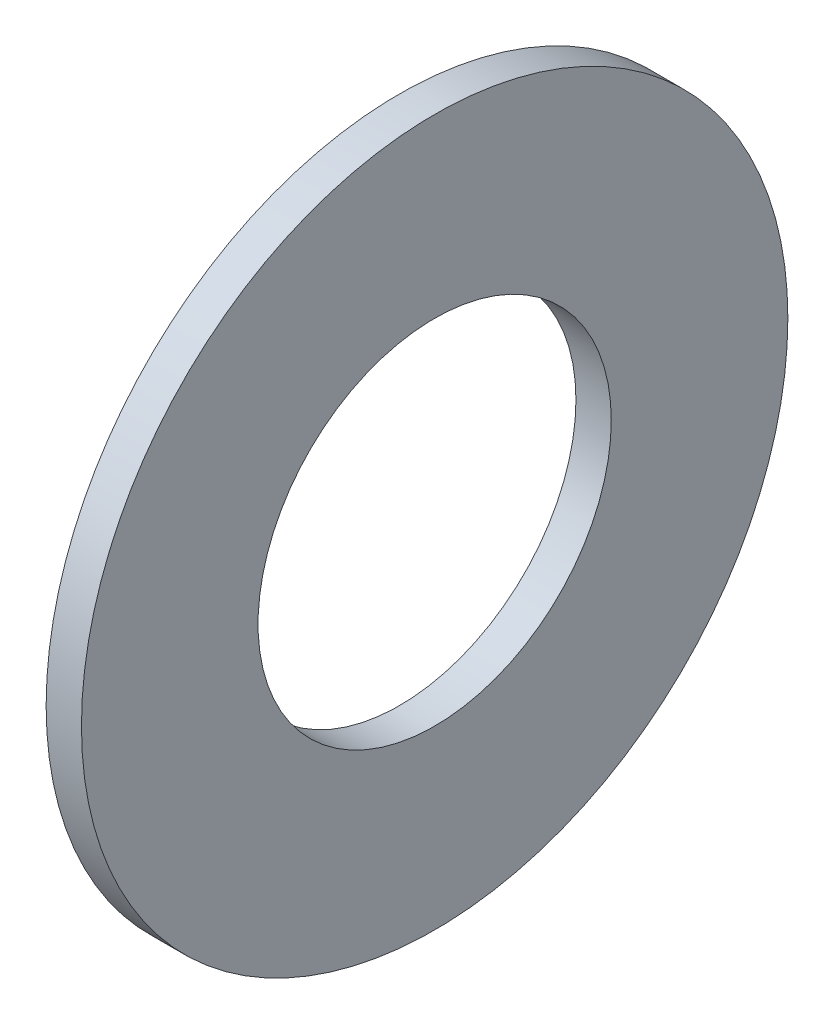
from build123d import *

# Parameters (mm, degrees)
SKETCH1_R           = 5
SKETCH1_R_2         = 2.5
BOSS_EXTRUDE1_DEPTH = 0.5


with BuildPart() as part:
    # Sketch1 → Boss-Extrude1 (new body)
    with BuildSketch(Plane(origin=(0, 0, 0), x_dir=(0, 0, -1), z_dir=(1, 0, 0))):
        Circle(SKETCH1_R)
        Circle(SKETCH1_R_2, mode=Mode.SUBTRACT)
    extrude(amount=BOSS_EXTRUDE1_DEPTH)


solid = part.part
